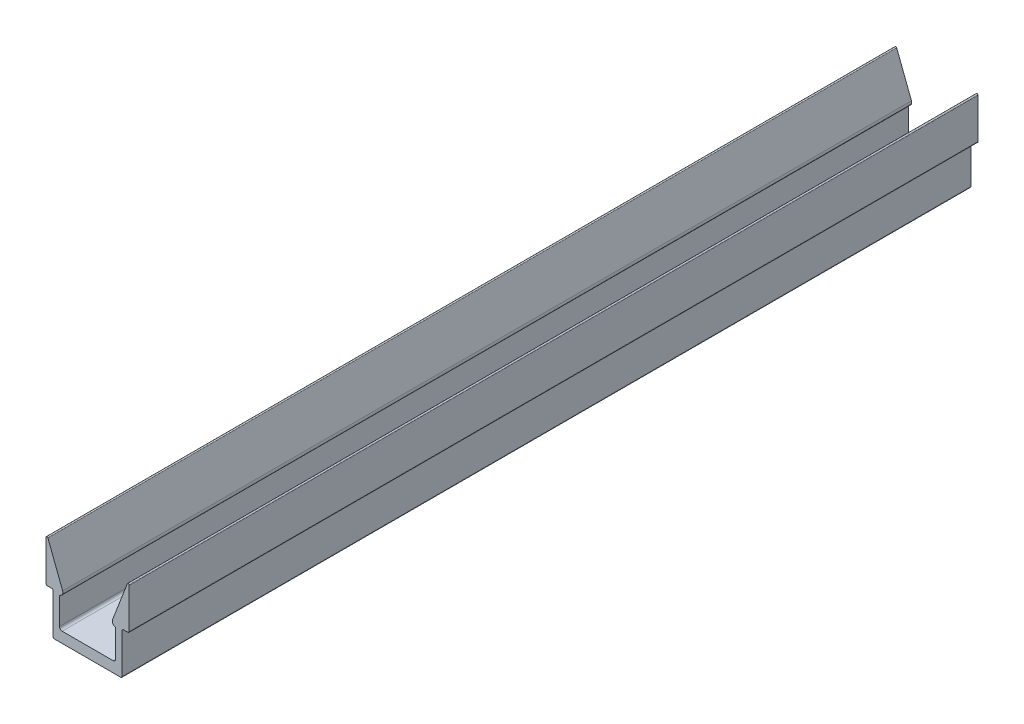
ISO-10303-21;
HEADER;
FILE_DESCRIPTION(('STEP AP214'),'2;1');
FILE_NAME('part.step','',(''),(''),'','','');
FILE_SCHEMA(('AUTOMOTIVE_DESIGN { 1 0 10303 214 1 1 1 1 }'));
ENDSEC;
DATA;
#1=APPLICATION_CONTEXT('core data for automotive mechanical design processes');
#2=APPLICATION_PROTOCOL_DEFINITION('international standard','automotive_design',2000,#1);
#3=PRODUCT_CONTEXT('',#1,'mechanical');
#4=PRODUCT('Part','Part','',(#3));
#5=PRODUCT_RELATED_PRODUCT_CATEGORY('part','',(#4));
#6=PRODUCT_DEFINITION_FORMATION('','',#4);
#7=PRODUCT_DEFINITION_CONTEXT('part definition',#1,'design');
#8=PRODUCT_DEFINITION('design','',#6,#7);
#9=PRODUCT_DEFINITION_SHAPE('','',#8);
#10=(LENGTH_UNIT() NAMED_UNIT(*) SI_UNIT(.MILLI.,.METRE.));
#11=(NAMED_UNIT(*) PLANE_ANGLE_UNIT() SI_UNIT($,.RADIAN.));
#12=(NAMED_UNIT(*) SI_UNIT($,.STERADIAN.) SOLID_ANGLE_UNIT());
#13=UNCERTAINTY_MEASURE_WITH_UNIT(LENGTH_MEASURE(1.E-05),#10,'distance_accuracy_value','');
#14=(GEOMETRIC_REPRESENTATION_CONTEXT(3) GLOBAL_UNCERTAINTY_ASSIGNED_CONTEXT((#13)) GLOBAL_UNIT_ASSIGNED_CONTEXT((#10,
#11,#12)) REPRESENTATION_CONTEXT('',''));
#15=CARTESIAN_POINT('',(0.,0.,0.));
#16=DIRECTION('',(0.,0.,1.));
#17=DIRECTION('',(1.,0.,0.));
#18=AXIS2_PLACEMENT_3D('',#15,#16,#17);
#19=CARTESIAN_POINT('',(24.3078,50.2158,508.));
#20=DIRECTION('',(0.,0.,-1.));
#21=DIRECTION('',(-1.,0.,0.));
#22=AXIS2_PLACEMENT_3D('',#19,#20,#21);
#23=CYLINDRICAL_SURFACE('',#22,0.5842);
#24=CARTESIAN_POINT('',(24.3078,50.2158,0.));
#25=DIRECTION('',(0.,0.,1.));
#26=DIRECTION('',(1.,0.,0.));
#27=AXIS2_PLACEMENT_3D('',#24,#25,#26);
#28=CIRCLE('',#27,0.5842);
#29=CARTESIAN_POINT('',(24.892,50.2158,0.));
#30=VERTEX_POINT('',#29);
#31=CARTESIAN_POINT('',(23.7624023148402,50.4251585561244,0.));
#32=VERTEX_POINT('',#31);
#33=EDGE_CURVE('E190',#30,#32,#28,.T.);
#34=ORIENTED_EDGE('',*,*,#33,.T.);
#35=DIRECTION('',(0.,0.,-1.));
#36=VECTOR('',#35,1.);
#37=CARTESIAN_POINT('',(23.7624023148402,50.4251585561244,508.));
#38=LINE('',#37,#36);
#39=CARTESIAN_POINT('',(23.7624023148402,50.4251585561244,508.));
#40=VERTEX_POINT('',#39);
#41=EDGE_CURVE('E9',#40,#32,#38,.T.);
#42=ORIENTED_EDGE('',*,*,#41,.F.);
#43=CARTESIAN_POINT('',(24.3078,50.2158,508.));
#44=DIRECTION('',(0.,0.,1.));
#45=DIRECTION('',(1.,0.,0.));
#46=AXIS2_PLACEMENT_3D('',#43,#44,#45);
#47=CIRCLE('',#46,0.5842);
#48=CARTESIAN_POINT('',(24.892,50.2158,508.));
#49=VERTEX_POINT('',#48);
#50=EDGE_CURVE('E253',#49,#40,#47,.T.);
#51=ORIENTED_EDGE('',*,*,#50,.F.);
#52=DIRECTION('',(0.,0.,-1.));
#53=VECTOR('',#52,1.);
#54=CARTESIAN_POINT('',(24.892,50.2158,508.));
#55=LINE('',#54,#53);
#56=EDGE_CURVE('E203',#49,#30,#55,.T.);
#57=ORIENTED_EDGE('',*,*,#56,.T.);
#58=EDGE_LOOP('',(#34,#42,#51,#57));
#59=FACE_BOUND('',#58,.T.);
#60=ADVANCED_FACE('F14',(#59),#23,.T.);
#61=CARTESIAN_POINT('',(23.7624023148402,50.4251585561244,508.));
#62=DIRECTION('',(0.9335804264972,-0.358367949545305,0.));
#63=DIRECTION('',(0.358367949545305,0.9335804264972,0.));
#64=AXIS2_PLACEMENT_3D('',#61,#62,#63);
#65=PLANE('',#64);
#66=DIRECTION('',(-0.358367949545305,-0.9335804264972,0.));
#67=VECTOR('',#66,1.);
#68=CARTESIAN_POINT('',(23.7624023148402,50.4251585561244,0.));
#69=LINE('',#68,#67);
#70=CARTESIAN_POINT('',(14.9214778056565,27.3937627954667,0.));
#71=VERTEX_POINT('',#70);
#72=EDGE_CURVE('E186',#32,#71,#69,.T.);
#73=ORIENTED_EDGE('',*,*,#72,.T.);
#74=DIRECTION('',(0.,0.,-1.));
#75=VECTOR('',#74,1.);
#76=CARTESIAN_POINT('',(14.9214778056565,27.3937627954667,508.));
#77=LINE('',#76,#75);
#78=CARTESIAN_POINT('',(14.9214778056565,27.3937627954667,508.));
#79=VERTEX_POINT('',#78);
#80=EDGE_CURVE('E21',#79,#71,#77,.T.);
#81=ORIENTED_EDGE('',*,*,#80,.F.);
#82=DIRECTION('',(-0.358367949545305,-0.9335804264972,0.));
#83=VECTOR('',#82,1.);
#84=CARTESIAN_POINT('',(23.7624023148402,50.4251585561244,508.));
#85=LINE('',#84,#83);
#86=EDGE_CURVE('E199',#40,#79,#85,.T.);
#87=ORIENTED_EDGE('',*,*,#86,.F.);
#88=ORIENTED_EDGE('',*,*,#41,.T.);
#89=EDGE_LOOP('',(#73,#81,#87,#88));
#90=FACE_BOUND('',#89,.T.);
#91=ADVANCED_FACE('F198',(#90),#65,.F.);
#92=CARTESIAN_POINT('',(17.0082167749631,26.5927387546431,508.));
#93=DIRECTION('',(0.,0.,-1.));
#94=DIRECTION('',(-1.,0.,0.));
#95=AXIS2_PLACEMENT_3D('',#92,#93,#94);
#96=CYLINDRICAL_SURFACE('',#95,2.2352);
#97=CARTESIAN_POINT('',(17.0082167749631,26.5927387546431,0.));
#98=DIRECTION('',(0.,0.,1.));
#99=DIRECTION('',(1.,0.,0.));
#100=AXIS2_PLACEMENT_3D('',#97,#98,#99);
#101=CIRCLE('',#100,2.2352);
#102=CARTESIAN_POINT('',(16.3051737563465,24.4709825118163,0.));
#103=VERTEX_POINT('',#102);
#104=EDGE_CURVE('E192',#71,#103,#101,.T.);
#105=ORIENTED_EDGE('',*,*,#104,.T.);
#106=DIRECTION('',(0.,0.,-1.));
#107=VECTOR('',#106,1.);
#108=CARTESIAN_POINT('',(16.3051737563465,24.4709825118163,508.));
#109=LINE('',#108,#107);
#110=CARTESIAN_POINT('',(16.3051737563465,24.4709825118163,508.));
#111=VERTEX_POINT('',#110);
#112=EDGE_CURVE('E369',#111,#103,#109,.T.);
#113=ORIENTED_EDGE('',*,*,#112,.F.);
#114=CARTESIAN_POINT('',(17.0082167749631,26.5927387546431,508.));
#115=DIRECTION('',(0.,0.,1.));
#116=DIRECTION('',(1.,0.,0.));
#117=AXIS2_PLACEMENT_3D('',#114,#115,#116);
#118=CIRCLE('',#117,2.2352);
#119=EDGE_CURVE('E256',#79,#111,#118,.T.);
#120=ORIENTED_EDGE('',*,*,#119,.F.);
#121=ORIENTED_EDGE('',*,*,#80,.T.);
#122=EDGE_LOOP('',(#105,#113,#120,#121));
#123=FACE_BOUND('',#122,.T.);
#124=ADVANCED_FACE('F373',(#123),#96,.T.);
#125=CARTESIAN_POINT('',(16.0655,23.7476565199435,508.));
#126=DIRECTION('',(0.,0.,-1.));
#127=DIRECTION('',(-1.,0.,0.));
#128=AXIS2_PLACEMENT_3D('',#125,#126,#127);
#129=CYLINDRICAL_SURFACE('',#128,0.762);
#130=CARTESIAN_POINT('',(16.0655,23.7476565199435,0.));
#131=DIRECTION('',(0.,0.,-1.));
#132=DIRECTION('',(1.,0.,0.));
#133=AXIS2_PLACEMENT_3D('',#130,#131,#132);
#134=CIRCLE('',#133,0.762);
#135=CARTESIAN_POINT('',(16.8275,23.7476565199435,0.));
#136=VERTEX_POINT('',#135);
#137=EDGE_CURVE('E207',#103,#136,#134,.T.);
#138=ORIENTED_EDGE('',*,*,#137,.T.);
#139=DIRECTION('',(0.,0.,-1.));
#140=VECTOR('',#139,1.);
#141=CARTESIAN_POINT('',(16.8275,23.7476565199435,508.));
#142=LINE('',#141,#140);
#143=CARTESIAN_POINT('',(16.8275,23.7476565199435,508.));
#144=VERTEX_POINT('',#143);
#145=EDGE_CURVE('E366',#144,#136,#142,.T.);
#146=ORIENTED_EDGE('',*,*,#145,.F.);
#147=CARTESIAN_POINT('',(16.0655,23.7476565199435,508.));
#148=DIRECTION('',(0.,0.,-1.));
#149=DIRECTION('',(1.,0.,0.));
#150=AXIS2_PLACEMENT_3D('',#147,#148,#149);
#151=CIRCLE('',#150,0.762);
#152=EDGE_CURVE('E258',#111,#144,#151,.T.);
#153=ORIENTED_EDGE('',*,*,#152,.F.);
#154=ORIENTED_EDGE('',*,*,#112,.T.);
#155=EDGE_LOOP('',(#138,#146,#153,#154));
#156=FACE_BOUND('',#155,.T.);
#157=ADVANCED_FACE('F381',(#156),#129,.F.);
#158=CARTESIAN_POINT('',(16.8275,7.9502,508.));
#159=DIRECTION('',(1.,0.,0.));
#160=DIRECTION('',(0.,0.,-1.));
#161=AXIS2_PLACEMENT_3D('',#158,#159,#160);
#162=PLANE('',#161);
#163=DIRECTION('',(0.,-1.,0.));
#164=VECTOR('',#163,1.);
#165=CARTESIAN_POINT('',(16.8275,7.9502,0.));
#166=LINE('',#165,#164);
#167=CARTESIAN_POINT('',(16.8275,7.9502,0.));
#168=VERTEX_POINT('',#167);
#169=EDGE_CURVE('E209',#136,#168,#166,.T.);
#170=ORIENTED_EDGE('',*,*,#169,.T.);
#171=DIRECTION('',(0.,0.,-1.));
#172=VECTOR('',#171,1.);
#173=CARTESIAN_POINT('',(16.8275,7.9502,508.));
#174=LINE('',#173,#172);
#175=CARTESIAN_POINT('',(16.8275,7.9502,508.));
#176=VERTEX_POINT('',#175);
#177=EDGE_CURVE('E363',#176,#168,#174,.T.);
#178=ORIENTED_EDGE('',*,*,#177,.F.);
#179=DIRECTION('',(0.,-1.,0.));
#180=VECTOR('',#179,1.);
#181=CARTESIAN_POINT('',(16.8275,7.9502,508.));
#182=LINE('',#181,#180);
#183=EDGE_CURVE('E260',#144,#176,#182,.T.);
#184=ORIENTED_EDGE('',*,*,#183,.F.);
#185=ORIENTED_EDGE('',*,*,#145,.T.);
#186=EDGE_LOOP('',(#170,#178,#184,#185));
#187=FACE_BOUND('',#186,.T.);
#188=ADVANCED_FACE('F384',(#187),#162,.F.);
#189=CARTESIAN_POINT('',(15.2273,7.9502,508.));
#190=DIRECTION('',(0.,0.,-1.));
#191=DIRECTION('',(-1.,0.,0.));
#192=AXIS2_PLACEMENT_3D('',#189,#190,#191);
#193=CYLINDRICAL_SURFACE('',#192,1.6002);
#194=CARTESIAN_POINT('',(15.2273,7.9502,0.));
#195=DIRECTION('',(0.,0.,-1.));
#196=DIRECTION('',(1.,0.,0.));
#197=AXIS2_PLACEMENT_3D('',#194,#195,#196);
#198=CIRCLE('',#197,1.6002);
#199=CARTESIAN_POINT('',(15.2273,6.35,0.));
#200=VERTEX_POINT('',#199);
#201=EDGE_CURVE('E211',#168,#200,#198,.T.);
#202=ORIENTED_EDGE('',*,*,#201,.T.);
#203=DIRECTION('',(0.,0.,-1.));
#204=VECTOR('',#203,1.);
#205=CARTESIAN_POINT('',(15.2273,6.35,508.));
#206=LINE('',#205,#204);
#207=CARTESIAN_POINT('',(15.2273,6.35,508.));
#208=VERTEX_POINT('',#207);
#209=EDGE_CURVE('E360',#208,#200,#206,.T.);
#210=ORIENTED_EDGE('',*,*,#209,.F.);
#211=CARTESIAN_POINT('',(15.2273,7.9502,508.));
#212=DIRECTION('',(0.,0.,-1.));
#213=DIRECTION('',(1.,0.,0.));
#214=AXIS2_PLACEMENT_3D('',#211,#212,#213);
#215=CIRCLE('',#214,1.6002);
#216=EDGE_CURVE('E262',#176,#208,#215,.T.);
#217=ORIENTED_EDGE('',*,*,#216,.F.);
#218=ORIENTED_EDGE('',*,*,#177,.T.);
#219=EDGE_LOOP('',(#202,#210,#217,#218));
#220=FACE_BOUND('',#219,.T.);
#221=ADVANCED_FACE('F389',(#220),#193,.F.);
#222=CARTESIAN_POINT('',(-15.2273,6.35,508.));
#223=DIRECTION('',(0.,-1.,0.));
#224=DIRECTION('',(0.,0.,-1.));
#225=AXIS2_PLACEMENT_3D('',#222,#223,#224);
#226=PLANE('',#225);
#227=DIRECTION('',(-1.,0.,0.));
#228=VECTOR('',#227,1.);
#229=CARTESIAN_POINT('',(-15.2273,6.35,0.));
#230=LINE('',#229,#228);
#231=CARTESIAN_POINT('',(-15.2273,6.35,0.));
#232=VERTEX_POINT('',#231);
#233=EDGE_CURVE('E213',#200,#232,#230,.T.);
#234=ORIENTED_EDGE('',*,*,#233,.T.);
#235=DIRECTION('',(0.,0.,-1.));
#236=VECTOR('',#235,1.);
#237=CARTESIAN_POINT('',(-15.2273,6.35,508.));
#238=LINE('',#237,#236);
#239=CARTESIAN_POINT('',(-15.2273,6.35,508.));
#240=VERTEX_POINT('',#239);
#241=EDGE_CURVE('E357',#240,#232,#238,.T.);
#242=ORIENTED_EDGE('',*,*,#241,.F.);
#243=DIRECTION('',(-1.,0.,0.));
#244=VECTOR('',#243,1.);
#245=CARTESIAN_POINT('',(-15.2273,6.35,508.));
#246=LINE('',#245,#244);
#247=EDGE_CURVE('E264',#208,#240,#246,.T.);
#248=ORIENTED_EDGE('',*,*,#247,.F.);
#249=ORIENTED_EDGE('',*,*,#209,.T.);
#250=EDGE_LOOP('',(#234,#242,#248,#249));
#251=FACE_BOUND('',#250,.T.);
#252=ADVANCED_FACE('F395',(#251),#226,.F.);
#253=CARTESIAN_POINT('',(-15.2273,7.9502,508.));
#254=DIRECTION('',(0.,0.,-1.));
#255=DIRECTION('',(-1.,0.,0.));
#256=AXIS2_PLACEMENT_3D('',#253,#254,#255);
#257=CYLINDRICAL_SURFACE('',#256,1.6002);
#258=CARTESIAN_POINT('',(-15.2273,7.9502,0.));
#259=DIRECTION('',(0.,0.,-1.));
#260=DIRECTION('',(-1.,0.,0.));
#261=AXIS2_PLACEMENT_3D('',#258,#259,#260);
#262=CIRCLE('',#261,1.6002);
#263=CARTESIAN_POINT('',(-16.8275,7.9502,0.));
#264=VERTEX_POINT('',#263);
#265=EDGE_CURVE('E215',#232,#264,#262,.T.);
#266=ORIENTED_EDGE('',*,*,#265,.T.);
#267=DIRECTION('',(0.,0.,-1.));
#268=VECTOR('',#267,1.);
#269=CARTESIAN_POINT('',(-16.8275,7.9502,508.));
#270=LINE('',#269,#268);
#271=CARTESIAN_POINT('',(-16.8275,7.9502,508.));
#272=VERTEX_POINT('',#271);
#273=EDGE_CURVE('E354',#272,#264,#270,.T.);
#274=ORIENTED_EDGE('',*,*,#273,.F.);
#275=CARTESIAN_POINT('',(-15.2273,7.9502,508.));
#276=DIRECTION('',(0.,0.,-1.));
#277=DIRECTION('',(-1.,0.,0.));
#278=AXIS2_PLACEMENT_3D('',#275,#276,#277);
#279=CIRCLE('',#278,1.6002);
#280=EDGE_CURVE('E266',#240,#272,#279,.T.);
#281=ORIENTED_EDGE('',*,*,#280,.F.);
#282=ORIENTED_EDGE('',*,*,#241,.T.);
#283=EDGE_LOOP('',(#266,#274,#281,#282));
#284=FACE_BOUND('',#283,.T.);
#285=ADVANCED_FACE('F399',(#284),#257,.F.);
#286=CARTESIAN_POINT('',(-16.8275,7.9502,508.));
#287=DIRECTION('',(-1.,0.,0.));
#288=DIRECTION('',(0.,0.,1.));
#289=AXIS2_PLACEMENT_3D('',#286,#287,#288);
#290=PLANE('',#289);
#291=DIRECTION('',(0.,1.,0.));
#292=VECTOR('',#291,1.);
#293=CARTESIAN_POINT('',(-16.8275,7.9502,0.));
#294=LINE('',#293,#292);
#295=CARTESIAN_POINT('',(-16.8275,23.7476565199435,0.));
#296=VERTEX_POINT('',#295);
#297=EDGE_CURVE('E217',#264,#296,#294,.T.);
#298=ORIENTED_EDGE('',*,*,#297,.T.);
#299=DIRECTION('',(0.,0.,-1.));
#300=VECTOR('',#299,1.);
#301=CARTESIAN_POINT('',(-16.8275,23.7476565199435,508.));
#302=LINE('',#301,#300);
#303=CARTESIAN_POINT('',(-16.8275,23.7476565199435,508.));
#304=VERTEX_POINT('',#303);
#305=EDGE_CURVE('E351',#304,#296,#302,.T.);
#306=ORIENTED_EDGE('',*,*,#305,.F.);
#307=DIRECTION('',(0.,1.,0.));
#308=VECTOR('',#307,1.);
#309=CARTESIAN_POINT('',(-16.8275,7.9502,508.));
#310=LINE('',#309,#308);
#311=EDGE_CURVE('E268',#272,#304,#310,.T.);
#312=ORIENTED_EDGE('',*,*,#311,.F.);
#313=ORIENTED_EDGE('',*,*,#273,.T.);
#314=EDGE_LOOP('',(#298,#306,#312,#313));
#315=FACE_BOUND('',#314,.T.);
#316=ADVANCED_FACE('F404',(#315),#290,.F.);
#317=CARTESIAN_POINT('',(-16.0655,23.7476565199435,508.));
#318=DIRECTION('',(0.,0.,-1.));
#319=DIRECTION('',(-1.,0.,0.));
#320=AXIS2_PLACEMENT_3D('',#317,#318,#319);
#321=CYLINDRICAL_SURFACE('',#320,0.762);
#322=CARTESIAN_POINT('',(-16.0655,23.7476565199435,0.));
#323=DIRECTION('',(0.,0.,-1.));
#324=DIRECTION('',(-1.,0.,0.));
#325=AXIS2_PLACEMENT_3D('',#322,#323,#324);
#326=CIRCLE('',#325,0.762);
#327=CARTESIAN_POINT('',(-16.3051737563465,24.4709825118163,0.));
#328=VERTEX_POINT('',#327);
#329=EDGE_CURVE('E219',#296,#328,#326,.T.);
#330=ORIENTED_EDGE('',*,*,#329,.T.);
#331=DIRECTION('',(0.,0.,-1.));
#332=VECTOR('',#331,1.);
#333=CARTESIAN_POINT('',(-16.3051737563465,24.4709825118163,508.));
#334=LINE('',#333,#332);
#335=CARTESIAN_POINT('',(-16.3051737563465,24.4709825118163,508.));
#336=VERTEX_POINT('',#335);
#337=EDGE_CURVE('E348',#336,#328,#334,.T.);
#338=ORIENTED_EDGE('',*,*,#337,.F.);
#339=CARTESIAN_POINT('',(-16.0655,23.7476565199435,508.));
#340=DIRECTION('',(0.,0.,-1.));
#341=DIRECTION('',(-1.,0.,0.));
#342=AXIS2_PLACEMENT_3D('',#339,#340,#341);
#343=CIRCLE('',#342,0.762);
#344=EDGE_CURVE('E270',#304,#336,#343,.T.);
#345=ORIENTED_EDGE('',*,*,#344,.F.);
#346=ORIENTED_EDGE('',*,*,#305,.T.);
#347=EDGE_LOOP('',(#330,#338,#345,#346));
#348=FACE_BOUND('',#347,.T.);
#349=ADVANCED_FACE('F410',(#348),#321,.F.);
#350=CARTESIAN_POINT('',(-17.0082167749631,26.5927387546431,508.));
#351=DIRECTION('',(0.,0.,-1.));
#352=DIRECTION('',(-1.,0.,0.));
#353=AXIS2_PLACEMENT_3D('',#350,#351,#352);
#354=CYLINDRICAL_SURFACE('',#353,2.2352);
#355=CARTESIAN_POINT('',(-17.0082167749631,26.5927387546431,0.));
#356=DIRECTION('',(0.,0.,1.));
#357=DIRECTION('',(-1.,0.,0.));
#358=AXIS2_PLACEMENT_3D('',#355,#356,#357);
#359=CIRCLE('',#358,2.2352);
#360=CARTESIAN_POINT('',(-14.9214778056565,27.3937627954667,0.));
#361=VERTEX_POINT('',#360);
#362=EDGE_CURVE('E221',#328,#361,#359,.T.);
#363=ORIENTED_EDGE('',*,*,#362,.T.);
#364=DIRECTION('',(0.,0.,-1.));
#365=VECTOR('',#364,1.);
#366=CARTESIAN_POINT('',(-14.9214778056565,27.3937627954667,508.));
#367=LINE('',#366,#365);
#368=CARTESIAN_POINT('',(-14.9214778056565,27.3937627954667,508.));
#369=VERTEX_POINT('',#368);
#370=EDGE_CURVE('E345',#369,#361,#367,.T.);
#371=ORIENTED_EDGE('',*,*,#370,.F.);
#372=CARTESIAN_POINT('',(-17.0082167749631,26.5927387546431,508.));
#373=DIRECTION('',(0.,0.,1.));
#374=DIRECTION('',(-1.,0.,0.));
#375=AXIS2_PLACEMENT_3D('',#372,#373,#374);
#376=CIRCLE('',#375,2.2352);
#377=EDGE_CURVE('E272',#336,#369,#376,.T.);
#378=ORIENTED_EDGE('',*,*,#377,.F.);
#379=ORIENTED_EDGE('',*,*,#337,.T.);
#380=EDGE_LOOP('',(#363,#371,#378,#379));
#381=FACE_BOUND('',#380,.T.);
#382=ADVANCED_FACE('F414',(#381),#354,.T.);
#383=CARTESIAN_POINT('',(-23.7624023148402,50.4251585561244,508.));
#384=DIRECTION('',(-0.9335804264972,-0.358367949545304,0.));
#385=DIRECTION('',(0.358367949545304,-0.9335804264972,0.));
#386=AXIS2_PLACEMENT_3D('',#383,#384,#385);
#387=PLANE('',#386);
#388=DIRECTION('',(-0.358367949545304,0.9335804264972,0.));
#389=VECTOR('',#388,1.);
#390=CARTESIAN_POINT('',(-23.7624023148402,50.4251585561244,0.));
#391=LINE('',#390,#389);
#392=CARTESIAN_POINT('',(-23.7624023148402,50.4251585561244,0.));
#393=VERTEX_POINT('',#392);
#394=EDGE_CURVE('E223',#361,#393,#391,.T.);
#395=ORIENTED_EDGE('',*,*,#394,.T.);
#396=DIRECTION('',(0.,0.,-1.));
#397=VECTOR('',#396,1.);
#398=CARTESIAN_POINT('',(-23.7624023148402,50.4251585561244,508.));
#399=LINE('',#398,#397);
#400=CARTESIAN_POINT('',(-23.7624023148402,50.4251585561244,508.));
#401=VERTEX_POINT('',#400);
#402=EDGE_CURVE('E342',#401,#393,#399,.T.);
#403=ORIENTED_EDGE('',*,*,#402,.F.);
#404=DIRECTION('',(-0.358367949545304,0.9335804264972,0.));
#405=VECTOR('',#404,1.);
#406=CARTESIAN_POINT('',(-23.7624023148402,50.4251585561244,508.));
#407=LINE('',#406,#405);
#408=EDGE_CURVE('E274',#369,#401,#407,.T.);
#409=ORIENTED_EDGE('',*,*,#408,.F.);
#410=ORIENTED_EDGE('',*,*,#370,.T.);
#411=EDGE_LOOP('',(#395,#403,#409,#410));
#412=FACE_BOUND('',#411,.T.);
#413=ADVANCED_FACE('F419',(#412),#387,.F.);
#414=CARTESIAN_POINT('',(-24.3078,50.2158,508.));
#415=DIRECTION('',(0.,0.,-1.));
#416=DIRECTION('',(-1.,0.,0.));
#417=AXIS2_PLACEMENT_3D('',#414,#415,#416);
#418=CYLINDRICAL_SURFACE('',#417,0.5842);
#419=CARTESIAN_POINT('',(-24.3078,50.2158,0.));
#420=DIRECTION('',(0.,0.,1.));
#421=DIRECTION('',(-1.,0.,0.));
#422=AXIS2_PLACEMENT_3D('',#419,#420,#421);
#423=CIRCLE('',#422,0.5842);
#424=CARTESIAN_POINT('',(-24.892,50.2158,0.));
#425=VERTEX_POINT('',#424);
#426=EDGE_CURVE('E225',#393,#425,#423,.T.);
#427=ORIENTED_EDGE('',*,*,#426,.T.);
#428=DIRECTION('',(0.,0.,-1.));
#429=VECTOR('',#428,1.);
#430=CARTESIAN_POINT('',(-24.892,50.2158,508.));
#431=LINE('',#430,#429);
#432=CARTESIAN_POINT('',(-24.892,50.2158,508.));
#433=VERTEX_POINT('',#432);
#434=EDGE_CURVE('E339',#433,#425,#431,.T.);
#435=ORIENTED_EDGE('',*,*,#434,.F.);
#436=CARTESIAN_POINT('',(-24.3078,50.2158,508.));
#437=DIRECTION('',(0.,0.,1.));
#438=DIRECTION('',(-1.,0.,0.));
#439=AXIS2_PLACEMENT_3D('',#436,#437,#438);
#440=CIRCLE('',#439,0.5842);
#441=EDGE_CURVE('E276',#401,#433,#440,.T.);
#442=ORIENTED_EDGE('',*,*,#441,.F.);
#443=ORIENTED_EDGE('',*,*,#402,.T.);
#444=EDGE_LOOP('',(#427,#435,#442,#443));
#445=FACE_BOUND('',#444,.T.);
#446=ADVANCED_FACE('F425',(#445),#418,.T.);
#447=CARTESIAN_POINT('',(-24.892,26.2128,508.));
#448=DIRECTION('',(1.,0.,0.));
#449=DIRECTION('',(0.,1.,0.));
#450=AXIS2_PLACEMENT_3D('',#447,#448,#449);
#451=PLANE('',#450);
#452=DIRECTION('',(0.,-1.,0.));
#453=VECTOR('',#452,1.);
#454=CARTESIAN_POINT('',(-24.892,26.2128,0.));
#455=LINE('',#454,#453);
#456=CARTESIAN_POINT('',(-24.892,26.2128,0.));
#457=VERTEX_POINT('',#456);
#458=EDGE_CURVE('E227',#425,#457,#455,.T.);
#459=ORIENTED_EDGE('',*,*,#458,.T.);
#460=DIRECTION('',(0.,0.,-1.));
#461=VECTOR('',#460,1.);
#462=CARTESIAN_POINT('',(-24.892,26.2128,508.));
#463=LINE('',#462,#461);
#464=CARTESIAN_POINT('',(-24.892,26.2128,508.));
#465=VERTEX_POINT('',#464);
#466=EDGE_CURVE('E336',#465,#457,#463,.T.);
#467=ORIENTED_EDGE('',*,*,#466,.F.);
#468=DIRECTION('',(0.,-1.,0.));
#469=VECTOR('',#468,1.);
#470=CARTESIAN_POINT('',(-24.892,26.2128,508.));
#471=LINE('',#470,#469);
#472=EDGE_CURVE('E278',#433,#465,#471,.T.);
#473=ORIENTED_EDGE('',*,*,#472,.F.);
#474=ORIENTED_EDGE('',*,*,#434,.T.);
#475=EDGE_LOOP('',(#459,#467,#473,#474));
#476=FACE_BOUND('',#475,.T.);
#477=ADVANCED_FACE('F429',(#476),#451,.F.);
#478=CARTESIAN_POINT('',(-24.13,26.2128,508.));
#479=DIRECTION('',(0.,0.,-1.));
#480=DIRECTION('',(-1.,0.,0.));
#481=AXIS2_PLACEMENT_3D('',#478,#479,#480);
#482=CYLINDRICAL_SURFACE('',#481,0.762);
#483=CARTESIAN_POINT('',(-24.13,26.2128,0.));
#484=DIRECTION('',(0.,0.,1.));
#485=DIRECTION('',(-1.,0.,0.));
#486=AXIS2_PLACEMENT_3D('',#483,#484,#485);
#487=CIRCLE('',#486,0.762);
#488=CARTESIAN_POINT('',(-24.13,25.4508,0.));
#489=VERTEX_POINT('',#488);
#490=EDGE_CURVE('E229',#457,#489,#487,.T.);
#491=ORIENTED_EDGE('',*,*,#490,.T.);
#492=DIRECTION('',(0.,0.,-1.));
#493=VECTOR('',#492,1.);
#494=CARTESIAN_POINT('',(-24.13,25.4508,508.));
#495=LINE('',#494,#493);
#496=CARTESIAN_POINT('',(-24.13,25.4508,508.));
#497=VERTEX_POINT('',#496);
#498=EDGE_CURVE('E333',#497,#489,#495,.T.);
#499=ORIENTED_EDGE('',*,*,#498,.F.);
#500=CARTESIAN_POINT('',(-24.13,26.2128,508.));
#501=DIRECTION('',(0.,0.,1.));
#502=DIRECTION('',(-1.,0.,0.));
#503=AXIS2_PLACEMENT_3D('',#500,#501,#502);
#504=CIRCLE('',#503,0.762);
#505=EDGE_CURVE('E280',#465,#497,#504,.T.);
#506=ORIENTED_EDGE('',*,*,#505,.F.);
#507=ORIENTED_EDGE('',*,*,#466,.T.);
#508=EDGE_LOOP('',(#491,#499,#506,#507));
#509=FACE_BOUND('',#508,.T.);
#510=ADVANCED_FACE('F434',(#509),#482,.T.);
#511=CARTESIAN_POINT('',(-21.3995,25.4508,508.));
#512=DIRECTION('',(0.,1.,0.));
#513=DIRECTION('',(0.,0.,1.));
#514=AXIS2_PLACEMENT_3D('',#511,#512,#513);
#515=PLANE('',#514);
#516=DIRECTION('',(1.,0.,0.));
#517=VECTOR('',#516,1.);
#518=CARTESIAN_POINT('',(-21.3995,25.4508,0.));
#519=LINE('',#518,#517);
#520=CARTESIAN_POINT('',(-21.3995,25.4508,0.));
#521=VERTEX_POINT('',#520);
#522=EDGE_CURVE('E231',#489,#521,#519,.T.);
#523=ORIENTED_EDGE('',*,*,#522,.T.);
#524=DIRECTION('',(0.,0.,-1.));
#525=VECTOR('',#524,1.);
#526=CARTESIAN_POINT('',(-21.3995,25.4508,508.));
#527=LINE('',#526,#525);
#528=CARTESIAN_POINT('',(-21.3995,25.4508,508.));
#529=VERTEX_POINT('',#528);
#530=EDGE_CURVE('E330',#529,#521,#527,.T.);
#531=ORIENTED_EDGE('',*,*,#530,.F.);
#532=DIRECTION('',(1.,0.,0.));
#533=VECTOR('',#532,1.);
#534=CARTESIAN_POINT('',(-21.3995,25.4508,508.));
#535=LINE('',#534,#533);
#536=EDGE_CURVE('E282',#497,#529,#535,.T.);
#537=ORIENTED_EDGE('',*,*,#536,.F.);
#538=ORIENTED_EDGE('',*,*,#498,.T.);
#539=EDGE_LOOP('',(#523,#531,#537,#538));
#540=FACE_BOUND('',#539,.T.);
#541=ADVANCED_FACE('F440',(#540),#515,.F.);
#542=CARTESIAN_POINT('',(-21.3995,24.6888,508.));
#543=DIRECTION('',(0.,0.,-1.));
#544=DIRECTION('',(-1.,0.,0.));
#545=AXIS2_PLACEMENT_3D('',#542,#543,#544);
#546=CYLINDRICAL_SURFACE('',#545,0.762);
#547=CARTESIAN_POINT('',(-21.3995,24.6888,0.));
#548=DIRECTION('',(0.,0.,-1.));
#549=DIRECTION('',(1.,0.,0.));
#550=AXIS2_PLACEMENT_3D('',#547,#548,#549);
#551=CIRCLE('',#550,0.762);
#552=CARTESIAN_POINT('',(-20.6375,24.6888,0.));
#553=VERTEX_POINT('',#552);
#554=EDGE_CURVE('E233',#521,#553,#551,.T.);
#555=ORIENTED_EDGE('',*,*,#554,.T.);
#556=DIRECTION('',(0.,0.,-1.));
#557=VECTOR('',#556,1.);
#558=CARTESIAN_POINT('',(-20.6375,24.6888,508.));
#559=LINE('',#558,#557);
#560=CARTESIAN_POINT('',(-20.6375,24.6888,508.));
#561=VERTEX_POINT('',#560);
#562=EDGE_CURVE('E327',#561,#553,#559,.T.);
#563=ORIENTED_EDGE('',*,*,#562,.F.);
#564=CARTESIAN_POINT('',(-21.3995,24.6888,508.));
#565=DIRECTION('',(0.,0.,-1.));
#566=DIRECTION('',(1.,0.,0.));
#567=AXIS2_PLACEMENT_3D('',#564,#565,#566);
#568=CIRCLE('',#567,0.762);
#569=EDGE_CURVE('E284',#529,#561,#568,.T.);
#570=ORIENTED_EDGE('',*,*,#569,.F.);
#571=ORIENTED_EDGE('',*,*,#530,.T.);
#572=EDGE_LOOP('',(#555,#563,#570,#571));
#573=FACE_BOUND('',#572,.T.);
#574=ADVANCED_FACE('F444',(#573),#546,.F.);
#575=CARTESIAN_POINT('',(-20.6375,0.762,508.));
#576=DIRECTION('',(1.,0.,0.));
#577=DIRECTION('',(0.,0.,-1.));
#578=AXIS2_PLACEMENT_3D('',#575,#576,#577);
#579=PLANE('',#578);
#580=DIRECTION('',(0.,-1.,0.));
#581=VECTOR('',#580,1.);
#582=CARTESIAN_POINT('',(-20.6375,0.762,0.));
#583=LINE('',#582,#581);
#584=CARTESIAN_POINT('',(-20.6375,0.762,0.));
#585=VERTEX_POINT('',#584);
#586=EDGE_CURVE('E235',#553,#585,#583,.T.);
#587=ORIENTED_EDGE('',*,*,#586,.T.);
#588=DIRECTION('',(0.,0.,-1.));
#589=VECTOR('',#588,1.);
#590=CARTESIAN_POINT('',(-20.6375,0.762,508.));
#591=LINE('',#590,#589);
#592=CARTESIAN_POINT('',(-20.6375,0.762,508.));
#593=VERTEX_POINT('',#592);
#594=EDGE_CURVE('E324',#593,#585,#591,.T.);
#595=ORIENTED_EDGE('',*,*,#594,.F.);
#596=DIRECTION('',(0.,-1.,0.));
#597=VECTOR('',#596,1.);
#598=CARTESIAN_POINT('',(-20.6375,0.762,508.));
#599=LINE('',#598,#597);
#600=EDGE_CURVE('E286',#561,#593,#599,.T.);
#601=ORIENTED_EDGE('',*,*,#600,.F.);
#602=ORIENTED_EDGE('',*,*,#562,.T.);
#603=EDGE_LOOP('',(#587,#595,#601,#602));
#604=FACE_BOUND('',#603,.T.);
#605=ADVANCED_FACE('F449',(#604),#579,.F.);
#606=CARTESIAN_POINT('',(-19.8755,0.762,508.));
#607=DIRECTION('',(0.,0.,-1.));
#608=DIRECTION('',(-1.,0.,0.));
#609=AXIS2_PLACEMENT_3D('',#606,#607,#608);
#610=CYLINDRICAL_SURFACE('',#609,0.762);
#611=CARTESIAN_POINT('',(-19.8755,0.762,0.));
#612=DIRECTION('',(0.,0.,1.));
#613=DIRECTION('',(-1.,0.,0.));
#614=AXIS2_PLACEMENT_3D('',#611,#612,#613);
#615=CIRCLE('',#614,0.762);
#616=CARTESIAN_POINT('',(-19.8755,0.,0.));
#617=VERTEX_POINT('',#616);
#618=EDGE_CURVE('E237',#585,#617,#615,.T.);
#619=ORIENTED_EDGE('',*,*,#618,.T.);
#620=DIRECTION('',(0.,0.,-1.));
#621=VECTOR('',#620,1.);
#622=CARTESIAN_POINT('',(-19.8755,0.,508.));
#623=LINE('',#622,#621);
#624=CARTESIAN_POINT('',(-19.8755,0.,508.));
#625=VERTEX_POINT('',#624);
#626=EDGE_CURVE('E321',#625,#617,#623,.T.);
#627=ORIENTED_EDGE('',*,*,#626,.F.);
#628=CARTESIAN_POINT('',(-19.8755,0.762,508.));
#629=DIRECTION('',(0.,0.,1.));
#630=DIRECTION('',(-1.,0.,0.));
#631=AXIS2_PLACEMENT_3D('',#628,#629,#630);
#632=CIRCLE('',#631,0.762);
#633=EDGE_CURVE('E288',#593,#625,#632,.T.);
#634=ORIENTED_EDGE('',*,*,#633,.F.);
#635=ORIENTED_EDGE('',*,*,#594,.T.);
#636=EDGE_LOOP('',(#619,#627,#634,#635));
#637=FACE_BOUND('',#636,.T.);
#638=ADVANCED_FACE('F455',(#637),#610,.T.);
#639=CARTESIAN_POINT('',(-19.8755,0.,508.));
#640=DIRECTION('',(0.,1.,0.));
#641=DIRECTION('',(0.,0.,1.));
#642=AXIS2_PLACEMENT_3D('',#639,#640,#641);
#643=PLANE('',#642);
#644=DIRECTION('',(1.,0.,0.));
#645=VECTOR('',#644,1.);
#646=CARTESIAN_POINT('',(-19.8755,0.,0.));
#647=LINE('',#646,#645);
#648=CARTESIAN_POINT('',(19.8755,0.,0.));
#649=VERTEX_POINT('',#648);
#650=EDGE_CURVE('E239',#617,#649,#647,.T.);
#651=ORIENTED_EDGE('',*,*,#650,.T.);
#652=DIRECTION('',(0.,0.,-1.));
#653=VECTOR('',#652,1.);
#654=CARTESIAN_POINT('',(19.8755,0.,508.));
#655=LINE('',#654,#653);
#656=CARTESIAN_POINT('',(19.8755,0.,508.));
#657=VERTEX_POINT('',#656);
#658=EDGE_CURVE('E318',#657,#649,#655,.T.);
#659=ORIENTED_EDGE('',*,*,#658,.F.);
#660=DIRECTION('',(1.,0.,0.));
#661=VECTOR('',#660,1.);
#662=CARTESIAN_POINT('',(-19.8755,0.,508.));
#663=LINE('',#662,#661);
#664=EDGE_CURVE('E290',#625,#657,#663,.T.);
#665=ORIENTED_EDGE('',*,*,#664,.F.);
#666=ORIENTED_EDGE('',*,*,#626,.T.);
#667=EDGE_LOOP('',(#651,#659,#665,#666));
#668=FACE_BOUND('',#667,.T.);
#669=ADVANCED_FACE('F459',(#668),#643,.F.);
#670=CARTESIAN_POINT('',(19.8755,0.762,508.));
#671=DIRECTION('',(0.,0.,-1.));
#672=DIRECTION('',(-1.,0.,0.));
#673=AXIS2_PLACEMENT_3D('',#670,#671,#672);
#674=CYLINDRICAL_SURFACE('',#673,0.762);
#675=CARTESIAN_POINT('',(19.8755,0.762,0.));
#676=DIRECTION('',(0.,0.,1.));
#677=DIRECTION('',(1.,0.,0.));
#678=AXIS2_PLACEMENT_3D('',#675,#676,#677);
#679=CIRCLE('',#678,0.762);
#680=CARTESIAN_POINT('',(20.6375,0.762,0.));
#681=VERTEX_POINT('',#680);
#682=EDGE_CURVE('E241',#649,#681,#679,.T.);
#683=ORIENTED_EDGE('',*,*,#682,.T.);
#684=DIRECTION('',(0.,0.,-1.));
#685=VECTOR('',#684,1.);
#686=CARTESIAN_POINT('',(20.6375,0.762,508.));
#687=LINE('',#686,#685);
#688=CARTESIAN_POINT('',(20.6375,0.762,508.));
#689=VERTEX_POINT('',#688);
#690=EDGE_CURVE('E315',#689,#681,#687,.T.);
#691=ORIENTED_EDGE('',*,*,#690,.F.);
#692=CARTESIAN_POINT('',(19.8755,0.762,508.));
#693=DIRECTION('',(0.,0.,1.));
#694=DIRECTION('',(1.,0.,0.));
#695=AXIS2_PLACEMENT_3D('',#692,#693,#694);
#696=CIRCLE('',#695,0.762);
#697=EDGE_CURVE('E292',#657,#689,#696,.T.);
#698=ORIENTED_EDGE('',*,*,#697,.F.);
#699=ORIENTED_EDGE('',*,*,#658,.T.);
#700=EDGE_LOOP('',(#683,#691,#698,#699));
#701=FACE_BOUND('',#700,.T.);
#702=ADVANCED_FACE('F464',(#701),#674,.T.);
#703=CARTESIAN_POINT('',(20.6375,0.762,508.));
#704=DIRECTION('',(-1.,0.,0.));
#705=DIRECTION('',(0.,0.,1.));
#706=AXIS2_PLACEMENT_3D('',#703,#704,#705);
#707=PLANE('',#706);
#708=DIRECTION('',(0.,1.,0.));
#709=VECTOR('',#708,1.);
#710=CARTESIAN_POINT('',(20.6375,0.762,0.));
#711=LINE('',#710,#709);
#712=CARTESIAN_POINT('',(20.6375,24.6888,0.));
#713=VERTEX_POINT('',#712);
#714=EDGE_CURVE('E243',#681,#713,#711,.T.);
#715=ORIENTED_EDGE('',*,*,#714,.T.);
#716=DIRECTION('',(0.,0.,-1.));
#717=VECTOR('',#716,1.);
#718=CARTESIAN_POINT('',(20.6375,24.6888,508.));
#719=LINE('',#718,#717);
#720=CARTESIAN_POINT('',(20.6375,24.6888,508.));
#721=VERTEX_POINT('',#720);
#722=EDGE_CURVE('E312',#721,#713,#719,.T.);
#723=ORIENTED_EDGE('',*,*,#722,.F.);
#724=DIRECTION('',(0.,1.,0.));
#725=VECTOR('',#724,1.);
#726=CARTESIAN_POINT('',(20.6375,0.762,508.));
#727=LINE('',#726,#725);
#728=EDGE_CURVE('E294',#689,#721,#727,.T.);
#729=ORIENTED_EDGE('',*,*,#728,.F.);
#730=ORIENTED_EDGE('',*,*,#690,.T.);
#731=EDGE_LOOP('',(#715,#723,#729,#730));
#732=FACE_BOUND('',#731,.T.);
#733=ADVANCED_FACE('F470',(#732),#707,.F.);
#734=CARTESIAN_POINT('',(21.3995,24.6888,508.));
#735=DIRECTION('',(0.,0.,-1.));
#736=DIRECTION('',(-1.,0.,0.));
#737=AXIS2_PLACEMENT_3D('',#734,#735,#736);
#738=CYLINDRICAL_SURFACE('',#737,0.762);
#739=CARTESIAN_POINT('',(21.3995,24.6888,0.));
#740=DIRECTION('',(0.,0.,-1.));
#741=DIRECTION('',(-1.,0.,0.));
#742=AXIS2_PLACEMENT_3D('',#739,#740,#741);
#743=CIRCLE('',#742,0.762);
#744=CARTESIAN_POINT('',(21.3995,25.4508,0.));
#745=VERTEX_POINT('',#744);
#746=EDGE_CURVE('E245',#713,#745,#743,.T.);
#747=ORIENTED_EDGE('',*,*,#746,.T.);
#748=DIRECTION('',(0.,0.,-1.));
#749=VECTOR('',#748,1.);
#750=CARTESIAN_POINT('',(21.3995,25.4508,508.));
#751=LINE('',#750,#749);
#752=CARTESIAN_POINT('',(21.3995,25.4508,508.));
#753=VERTEX_POINT('',#752);
#754=EDGE_CURVE('E309',#753,#745,#751,.T.);
#755=ORIENTED_EDGE('',*,*,#754,.F.);
#756=CARTESIAN_POINT('',(21.3995,24.6888,508.));
#757=DIRECTION('',(0.,0.,-1.));
#758=DIRECTION('',(-1.,0.,0.));
#759=AXIS2_PLACEMENT_3D('',#756,#757,#758);
#760=CIRCLE('',#759,0.762);
#761=EDGE_CURVE('E296',#721,#753,#760,.T.);
#762=ORIENTED_EDGE('',*,*,#761,.F.);
#763=ORIENTED_EDGE('',*,*,#722,.T.);
#764=EDGE_LOOP('',(#747,#755,#762,#763));
#765=FACE_BOUND('',#764,.T.);
#766=ADVANCED_FACE('F474',(#765),#738,.F.);
#767=CARTESIAN_POINT('',(21.3995,25.4508,508.));
#768=DIRECTION('',(0.,1.,0.));
#769=DIRECTION('',(0.,0.,1.));
#770=AXIS2_PLACEMENT_3D('',#767,#768,#769);
#771=PLANE('',#770);
#772=DIRECTION('',(1.,0.,0.));
#773=VECTOR('',#772,1.);
#774=CARTESIAN_POINT('',(21.3995,25.4508,0.));
#775=LINE('',#774,#773);
#776=CARTESIAN_POINT('',(24.13,25.4508,0.));
#777=VERTEX_POINT('',#776);
#778=EDGE_CURVE('E247',#745,#777,#775,.T.);
#779=ORIENTED_EDGE('',*,*,#778,.T.);
#780=DIRECTION('',(0.,0.,-1.));
#781=VECTOR('',#780,1.);
#782=CARTESIAN_POINT('',(24.13,25.4508,508.));
#783=LINE('',#782,#781);
#784=CARTESIAN_POINT('',(24.13,25.4508,508.));
#785=VERTEX_POINT('',#784);
#786=EDGE_CURVE('E306',#785,#777,#783,.T.);
#787=ORIENTED_EDGE('',*,*,#786,.F.);
#788=DIRECTION('',(1.,0.,0.));
#789=VECTOR('',#788,1.);
#790=CARTESIAN_POINT('',(21.3995,25.4508,508.));
#791=LINE('',#790,#789);
#792=EDGE_CURVE('E298',#753,#785,#791,.T.);
#793=ORIENTED_EDGE('',*,*,#792,.F.);
#794=ORIENTED_EDGE('',*,*,#754,.T.);
#795=EDGE_LOOP('',(#779,#787,#793,#794));
#796=FACE_BOUND('',#795,.T.);
#797=ADVANCED_FACE('F479',(#796),#771,.F.);
#798=CARTESIAN_POINT('',(24.13,26.2128,508.));
#799=DIRECTION('',(0.,0.,-1.));
#800=DIRECTION('',(-1.,0.,0.));
#801=AXIS2_PLACEMENT_3D('',#798,#799,#800);
#802=CYLINDRICAL_SURFACE('',#801,0.762);
#803=CARTESIAN_POINT('',(24.13,26.2128,0.));
#804=DIRECTION('',(0.,0.,1.));
#805=DIRECTION('',(1.,0.,0.));
#806=AXIS2_PLACEMENT_3D('',#803,#804,#805);
#807=CIRCLE('',#806,0.762);
#808=CARTESIAN_POINT('',(24.892,26.2128,0.));
#809=VERTEX_POINT('',#808);
#810=EDGE_CURVE('E249',#777,#809,#807,.T.);
#811=ORIENTED_EDGE('',*,*,#810,.T.);
#812=DIRECTION('',(0.,0.,-1.));
#813=VECTOR('',#812,1.);
#814=CARTESIAN_POINT('',(24.892,26.2128,508.));
#815=LINE('',#814,#813);
#816=CARTESIAN_POINT('',(24.892,26.2128,508.));
#817=VERTEX_POINT('',#816);
#818=EDGE_CURVE('E303',#817,#809,#815,.T.);
#819=ORIENTED_EDGE('',*,*,#818,.F.);
#820=CARTESIAN_POINT('',(24.13,26.2128,508.));
#821=DIRECTION('',(0.,0.,1.));
#822=DIRECTION('',(1.,0.,0.));
#823=AXIS2_PLACEMENT_3D('',#820,#821,#822);
#824=CIRCLE('',#823,0.762);
#825=EDGE_CURVE('E33',#785,#817,#824,.T.);
#826=ORIENTED_EDGE('',*,*,#825,.F.);
#827=ORIENTED_EDGE('',*,*,#786,.T.);
#828=EDGE_LOOP('',(#811,#819,#826,#827));
#829=FACE_BOUND('',#828,.T.);
#830=ADVANCED_FACE('F482',(#829),#802,.T.);
#831=CARTESIAN_POINT('',(24.892,26.2128,508.));
#832=DIRECTION('',(-1.,0.,0.));
#833=DIRECTION('',(0.,-1.,0.));
#834=AXIS2_PLACEMENT_3D('',#831,#832,#833);
#835=PLANE('',#834);
#836=DIRECTION('',(0.,1.,0.));
#837=VECTOR('',#836,1.);
#838=CARTESIAN_POINT('',(24.892,26.2128,0.));
#839=LINE('',#838,#837);
#840=EDGE_CURVE('E251',#809,#30,#839,.T.);
#841=ORIENTED_EDGE('',*,*,#840,.T.);
#842=ORIENTED_EDGE('',*,*,#56,.F.);
#843=DIRECTION('',(0.,1.,0.));
#844=VECTOR('',#843,1.);
#845=CARTESIAN_POINT('',(24.892,26.2128,508.));
#846=LINE('',#845,#844);
#847=EDGE_CURVE('E28',#817,#49,#846,.T.);
#848=ORIENTED_EDGE('',*,*,#847,.F.);
#849=ORIENTED_EDGE('',*,*,#818,.T.);
#850=EDGE_LOOP('',(#841,#842,#848,#849));
#851=FACE_BOUND('',#850,.T.);
#852=ADVANCED_FACE('F484',(#851),#835,.F.);
#853=CARTESIAN_POINT('',(24.3078,50.2158,508.));
#854=DIRECTION('',(0.,0.,1.));
#855=DIRECTION('',(1.,0.,0.));
#856=AXIS2_PLACEMENT_3D('',#853,#854,#855);
#857=PLANE('',#856);
#858=ORIENTED_EDGE('',*,*,#50,.T.);
#859=ORIENTED_EDGE('',*,*,#86,.T.);
#860=ORIENTED_EDGE('',*,*,#119,.T.);
#861=ORIENTED_EDGE('',*,*,#152,.T.);
#862=ORIENTED_EDGE('',*,*,#183,.T.);
#863=ORIENTED_EDGE('',*,*,#216,.T.);
#864=ORIENTED_EDGE('',*,*,#247,.T.);
#865=ORIENTED_EDGE('',*,*,#280,.T.);
#866=ORIENTED_EDGE('',*,*,#311,.T.);
#867=ORIENTED_EDGE('',*,*,#344,.T.);
#868=ORIENTED_EDGE('',*,*,#377,.T.);
#869=ORIENTED_EDGE('',*,*,#408,.T.);
#870=ORIENTED_EDGE('',*,*,#441,.T.);
#871=ORIENTED_EDGE('',*,*,#472,.T.);
#872=ORIENTED_EDGE('',*,*,#505,.T.);
#873=ORIENTED_EDGE('',*,*,#536,.T.);
#874=ORIENTED_EDGE('',*,*,#569,.T.);
#875=ORIENTED_EDGE('',*,*,#600,.T.);
#876=ORIENTED_EDGE('',*,*,#633,.T.);
#877=ORIENTED_EDGE('',*,*,#664,.T.);
#878=ORIENTED_EDGE('',*,*,#697,.T.);
#879=ORIENTED_EDGE('',*,*,#728,.T.);
#880=ORIENTED_EDGE('',*,*,#761,.T.);
#881=ORIENTED_EDGE('',*,*,#792,.T.);
#882=ORIENTED_EDGE('',*,*,#825,.T.);
#883=ORIENTED_EDGE('',*,*,#847,.T.);
#884=EDGE_LOOP('',(#858,#859,#860,#861,#862,#863,#864,#865,#866,#867,#868,#869,#870,#871,#872,
#873,#874,#875,#876,#877,#878,#879,#880,#881,#882,#883));
#885=FACE_BOUND('',#884,.T.);
#886=ADVANCED_FACE('F376',(#885),#857,.T.);
#887=CARTESIAN_POINT('',(24.3078,50.2158,0.));
#888=DIRECTION('',(0.,0.,1.));
#889=DIRECTION('',(1.,0.,0.));
#890=AXIS2_PLACEMENT_3D('',#887,#888,#889);
#891=PLANE('',#890);
#892=ORIENTED_EDGE('',*,*,#33,.F.);
#893=ORIENTED_EDGE('',*,*,#840,.F.);
#894=ORIENTED_EDGE('',*,*,#810,.F.);
#895=ORIENTED_EDGE('',*,*,#778,.F.);
#896=ORIENTED_EDGE('',*,*,#746,.F.);
#897=ORIENTED_EDGE('',*,*,#714,.F.);
#898=ORIENTED_EDGE('',*,*,#682,.F.);
#899=ORIENTED_EDGE('',*,*,#650,.F.);
#900=ORIENTED_EDGE('',*,*,#618,.F.);
#901=ORIENTED_EDGE('',*,*,#586,.F.);
#902=ORIENTED_EDGE('',*,*,#554,.F.);
#903=ORIENTED_EDGE('',*,*,#522,.F.);
#904=ORIENTED_EDGE('',*,*,#490,.F.);
#905=ORIENTED_EDGE('',*,*,#458,.F.);
#906=ORIENTED_EDGE('',*,*,#426,.F.);
#907=ORIENTED_EDGE('',*,*,#394,.F.);
#908=ORIENTED_EDGE('',*,*,#362,.F.);
#909=ORIENTED_EDGE('',*,*,#329,.F.);
#910=ORIENTED_EDGE('',*,*,#297,.F.);
#911=ORIENTED_EDGE('',*,*,#265,.F.);
#912=ORIENTED_EDGE('',*,*,#233,.F.);
#913=ORIENTED_EDGE('',*,*,#201,.F.);
#914=ORIENTED_EDGE('',*,*,#169,.F.);
#915=ORIENTED_EDGE('',*,*,#137,.F.);
#916=ORIENTED_EDGE('',*,*,#104,.F.);
#917=ORIENTED_EDGE('',*,*,#72,.F.);
#918=EDGE_LOOP('',(#892,#893,#894,#895,#896,#897,#898,#899,#900,#901,#902,#903,#904,#905,#906,
#907,#908,#909,#910,#911,#912,#913,#914,#915,#916,#917));
#919=FACE_BOUND('',#918,.T.);
#920=ADVANCED_FACE('F187',(#919),#891,.F.);
#921=CLOSED_SHELL('',(#60,#91,#124,#157,#188,#221,#252,#285,#316,#349,#382,#413,#446,#477,#510,
#541,#574,#605,#638,#669,#702,#733,#766,#797,#830,#852,#886,#920));
#922=MANIFOLD_SOLID_BREP('B1',#921);
#923=ADVANCED_BREP_SHAPE_REPRESENTATION('',(#18,#922),#14);
#924=SHAPE_DEFINITION_REPRESENTATION(#9,#923);
ENDSEC;
END-ISO-10303-21;
